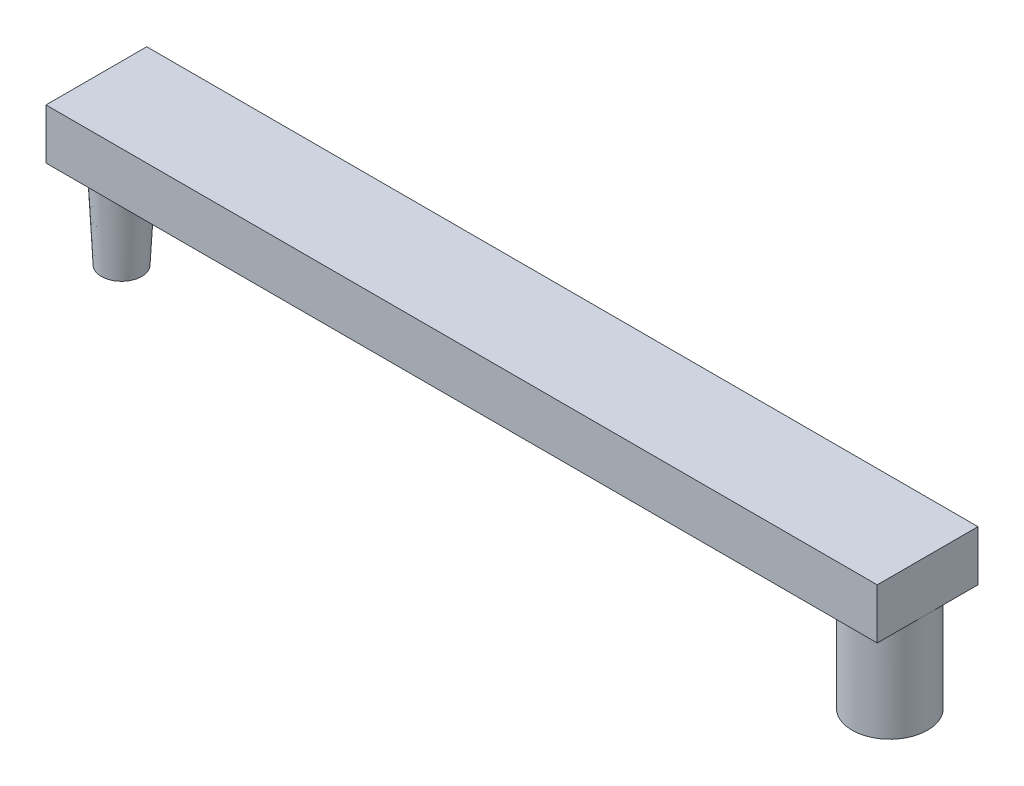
from build123d import *

# Parameters (mm, degrees)
CROQUIS2_W              = 16.5
CROQUIS2_H              = 2
SALIENTE_EXTRUIR2_DEPTH = 1
CROQUIS3_R              = 0.75
CROQUIS3_R_2            = 0.5
SALIENTE_EXTRUIR3_DEPTH = 2


with BuildPart() as part:
    # Croquis2 → Saliente-Extruir2 (new body)
    with BuildSketch(Plane(origin=(0, 0, 0), x_dir=(1, 0, 0), z_dir=(0, 1, 0))):
        Rectangle(CROQUIS2_W, CROQUIS2_H)
    extrude(amount=SALIENTE_EXTRUIR2_DEPTH)

    # Croquis3 → Saliente-Extruir3 (add)
    with BuildSketch(Plane.XZ):
        with Locations((7.5, 0)):
            Circle(CROQUIS3_R)
        with Locations(Location((-7.75, 0, 0), (0, 0, 180))):
            Circle(CROQUIS3_R_2)
    extrude(amount=SALIENTE_EXTRUIR3_DEPTH)

    # Croquis4 → Cortar-Revoluci_n2 (revolve, cut)
    with BuildSketch(Plane.XY):
        Polygon((-8.15, -2), (-8.25, -2), (-8.25, 0), align=None)
        Polygon((-7.25, 0), (-7.25, -2), (-7.35, -2), align=None)
    revolve(axis=Axis((-7.75, 0, 0), (0, -1, 0)), mode=Mode.SUBTRACT)


solid = part.part
